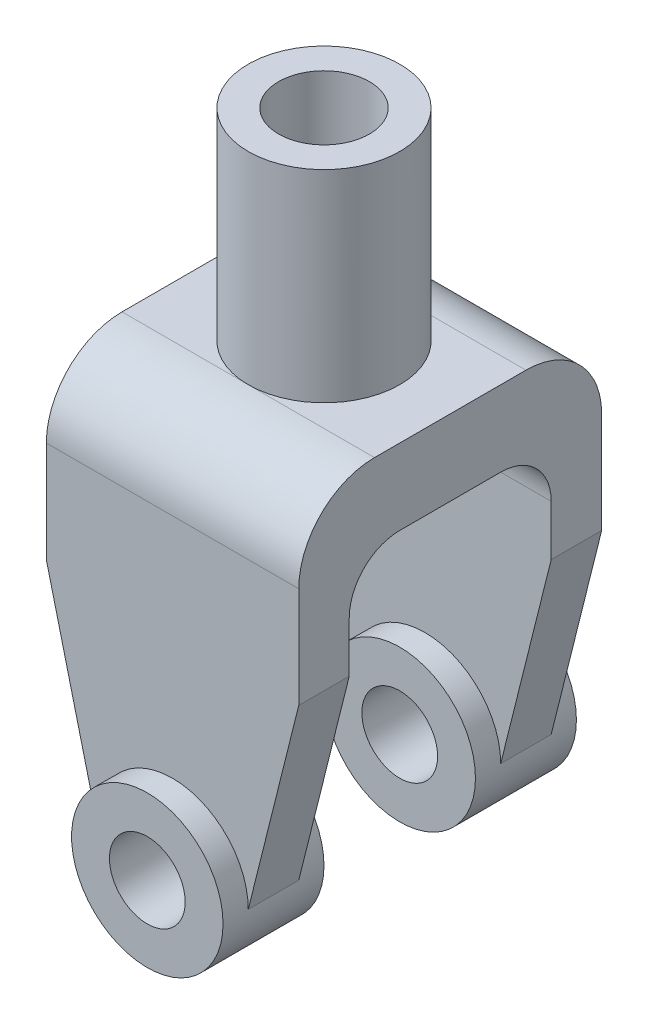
ISO-10303-21;
HEADER;
FILE_DESCRIPTION(('STEP AP214'),'2;1');
FILE_NAME('part.step','',(''),(''),'','','');
FILE_SCHEMA(('AUTOMOTIVE_DESIGN { 1 0 10303 214 1 1 1 1 }'));
ENDSEC;
DATA;
#1=APPLICATION_CONTEXT('core data for automotive mechanical design processes');
#2=APPLICATION_PROTOCOL_DEFINITION('international standard','automotive_design',2000,#1);
#3=PRODUCT_CONTEXT('',#1,'mechanical');
#4=PRODUCT('Part','Part','',(#3));
#5=PRODUCT_RELATED_PRODUCT_CATEGORY('part','',(#4));
#6=PRODUCT_DEFINITION_FORMATION('','',#4);
#7=PRODUCT_DEFINITION_CONTEXT('part definition',#1,'design');
#8=PRODUCT_DEFINITION('design','',#6,#7);
#9=PRODUCT_DEFINITION_SHAPE('','',#8);
#10=(LENGTH_UNIT() NAMED_UNIT(*) SI_UNIT(.MILLI.,.METRE.));
#11=(NAMED_UNIT(*) PLANE_ANGLE_UNIT() SI_UNIT($,.RADIAN.));
#12=(NAMED_UNIT(*) SI_UNIT($,.STERADIAN.) SOLID_ANGLE_UNIT());
#13=UNCERTAINTY_MEASURE_WITH_UNIT(LENGTH_MEASURE(1.E-05),#10,'distance_accuracy_value','');
#14=(GEOMETRIC_REPRESENTATION_CONTEXT(3) GLOBAL_UNCERTAINTY_ASSIGNED_CONTEXT((#13)) GLOBAL_UNIT_ASSIGNED_CONTEXT((#10,
#11,#12)) REPRESENTATION_CONTEXT('',''));
#15=CARTESIAN_POINT('',(0.,0.,0.));
#16=DIRECTION('',(0.,0.,1.));
#17=DIRECTION('',(1.,0.,0.));
#18=AXIS2_PLACEMENT_3D('',#15,#16,#17);
#19=CARTESIAN_POINT('',(50.,150.,0.));
#20=DIRECTION('',(0.,-1.,0.));
#21=DIRECTION('',(0.,0.,-1.));
#22=AXIS2_PLACEMENT_3D('',#19,#20,#21);
#23=PLANE('',#22);
#24=DIRECTION('',(0.,0.,1.));
#25=VECTOR('',#24,1.);
#26=CARTESIAN_POINT('',(50.,150.,0.));
#27=LINE('',#26,#25);
#28=CARTESIAN_POINT('',(50.,150.,-90.));
#29=VERTEX_POINT('',#28);
#30=CARTESIAN_POINT('',(50.,150.,-30.));
#31=VERTEX_POINT('',#30);
#32=EDGE_CURVE('E220',#29,#31,#27,.T.);
#33=ORIENTED_EDGE('',*,*,#32,.F.);
#34=DIRECTION('',(-1.,0.,0.));
#35=VECTOR('',#34,1.);
#36=CARTESIAN_POINT('',(50.,150.,-90.));
#37=LINE('',#36,#35);
#38=CARTESIAN_POINT('',(0.,150.,-90.));
#39=VERTEX_POINT('',#38);
#40=EDGE_CURVE('E246',#29,#39,#37,.T.);
#41=ORIENTED_EDGE('',*,*,#40,.T.);
#42=CARTESIAN_POINT('',(0.,150.,-60.));
#43=DIRECTION('',(0.,-1.,0.));
#44=DIRECTION('',(0.,0.,-1.));
#45=AXIS2_PLACEMENT_3D('',#42,#43,#44);
#46=CIRCLE('',#45,30.);
#47=CARTESIAN_POINT('',(0.,150.,-30.));
#48=VERTEX_POINT('',#47);
#49=EDGE_CURVE('E231',#48,#39,#46,.F.);
#50=ORIENTED_EDGE('',*,*,#49,.F.);
#51=DIRECTION('',(-1.,0.,0.));
#52=VECTOR('',#51,1.);
#53=CARTESIAN_POINT('',(50.,150.,-30.));
#54=LINE('',#53,#52);
#55=EDGE_CURVE('E240',#48,#31,#54,.F.);
#56=ORIENTED_EDGE('',*,*,#55,.T.);
#57=EDGE_LOOP('',(#33,#41,#50,#56));
#58=FACE_BOUND('',#57,.T.);
#59=ADVANCED_FACE('F35',(#58),#23,.F.);
#60=EDGE_CURVE('E237',#39,#48,#46,.F.);
#61=ORIENTED_EDGE('',*,*,#60,.F.);
#62=DIRECTION('',(-1.,0.,0.));
#63=VECTOR('',#62,1.);
#64=CARTESIAN_POINT('',(50.,150.,-90.));
#65=LINE('',#64,#63);
#66=CARTESIAN_POINT('',(-50.,150.,-90.));
#67=VERTEX_POINT('',#66);
#68=EDGE_CURVE('E244',#39,#67,#65,.T.);
#69=ORIENTED_EDGE('',*,*,#68,.T.);
#70=DIRECTION('',(0.,0.,1.));
#71=VECTOR('',#70,1.);
#72=CARTESIAN_POINT('',(-50.,150.,0.));
#73=LINE('',#72,#71);
#74=CARTESIAN_POINT('',(-50.,150.,-30.));
#75=VERTEX_POINT('',#74);
#76=EDGE_CURVE('E205',#67,#75,#73,.T.);
#77=ORIENTED_EDGE('',*,*,#76,.T.);
#78=DIRECTION('',(-1.,0.,0.));
#79=VECTOR('',#78,1.);
#80=CARTESIAN_POINT('',(50.,150.,-30.));
#81=LINE('',#80,#79);
#82=EDGE_CURVE('E242',#75,#48,#81,.F.);
#83=ORIENTED_EDGE('',*,*,#82,.T.);
#84=EDGE_LOOP('',(#61,#69,#77,#83));
#85=FACE_BOUND('',#84,.T.);
#86=ADVANCED_FACE('F354',(#85),#23,.F.);
#87=CARTESIAN_POINT('',(50.,120.,-20.));
#88=DIRECTION('',(0.,0.,1.));
#89=DIRECTION('',(0.,-1.,0.));
#90=AXIS2_PLACEMENT_3D('',#87,#88,#89);
#91=PLANE('',#90);
#92=DIRECTION('',(0.,1.,0.));
#93=VECTOR('',#92,1.);
#94=CARTESIAN_POINT('',(-50.,120.,-20.));
#95=LINE('',#94,#93);
#96=CARTESIAN_POINT('',(-50.,80.,-20.));
#97=VERTEX_POINT('',#96);
#98=CARTESIAN_POINT('',(-50.,100.,-20.));
#99=VERTEX_POINT('',#98);
#100=EDGE_CURVE('E195',#97,#99,#95,.T.);
#101=ORIENTED_EDGE('',*,*,#100,.T.);
#102=DIRECTION('',(-1.,0.,0.));
#103=VECTOR('',#102,1.);
#104=CARTESIAN_POINT('',(50.,100.,-20.));
#105=LINE('',#104,#103);
#106=CARTESIAN_POINT('',(50.,100.,-20.));
#107=VERTEX_POINT('',#106);
#108=EDGE_CURVE('E50',#99,#107,#105,.F.);
#109=ORIENTED_EDGE('',*,*,#108,.T.);
#110=DIRECTION('',(0.,1.,0.));
#111=VECTOR('',#110,1.);
#112=CARTESIAN_POINT('',(50.,120.,-20.));
#113=LINE('',#112,#111);
#114=CARTESIAN_POINT('',(50.,80.0000000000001,-20.));
#115=VERTEX_POINT('',#114);
#116=EDGE_CURVE('E210',#115,#107,#113,.T.);
#117=ORIENTED_EDGE('',*,*,#116,.F.);
#118=DIRECTION('',(0.242535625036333,0.970142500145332,0.));
#119=VECTOR('',#118,1.);
#120=CARTESIAN_POINT('',(59.4117647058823,117.647058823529,-20.));
#121=LINE('',#120,#119);
#122=CARTESIAN_POINT('',(30.,0.,-20.));
#123=VERTEX_POINT('',#122);
#124=EDGE_CURVE('E165',#123,#115,#121,.T.);
#125=ORIENTED_EDGE('',*,*,#124,.F.);
#126=CARTESIAN_POINT('',(0.,0.,-20.));
#127=DIRECTION('',(0.,0.,1.));
#128=DIRECTION('',(0.,-1.,0.));
#129=AXIS2_PLACEMENT_3D('',#126,#127,#128);
#130=CIRCLE('',#129,30.);
#131=CARTESIAN_POINT('',(-30.,0.,-20.));
#132=VERTEX_POINT('',#131);
#133=EDGE_CURVE('E302',#123,#132,#130,.T.);
#134=ORIENTED_EDGE('',*,*,#133,.T.);
#135=DIRECTION('',(0.242535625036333,-0.970142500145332,0.));
#136=VECTOR('',#135,1.);
#137=CARTESIAN_POINT('',(-53.5294117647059,94.1176470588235,-20.));
#138=LINE('',#137,#136);
#139=EDGE_CURVE('E166',#97,#132,#138,.T.);
#140=ORIENTED_EDGE('',*,*,#139,.F.);
#141=EDGE_LOOP('',(#101,#109,#117,#125,#134,#140));
#142=FACE_BOUND('',#141,.T.);
#143=ADVANCED_FACE('F37',(#142),#91,.F.);
#144=CARTESIAN_POINT('',(50.,120.,-100.));
#145=DIRECTION('',(0.,1.,0.));
#146=DIRECTION('',(0.,0.,1.));
#147=AXIS2_PLACEMENT_3D('',#144,#145,#146);
#148=PLANE('',#147);
#149=CARTESIAN_POINT('',(0.,120.,-60.));
#150=DIRECTION('',(0.,1.,0.));
#151=DIRECTION('',(0.,0.,1.));
#152=AXIS2_PLACEMENT_3D('',#149,#150,#151);
#153=CIRCLE('',#152,18.);
#154=CARTESIAN_POINT('',(0.,120.,-42.));
#155=VERTEX_POINT('',#154);
#156=EDGE_CURVE('E376',#155,#155,#153,.F.);
#157=ORIENTED_EDGE('',*,*,#156,.F.);
#158=EDGE_LOOP('',(#157));
#159=FACE_BOUND('',#158,.T.);
#160=DIRECTION('',(0.,0.,-1.));
#161=VECTOR('',#160,1.);
#162=CARTESIAN_POINT('',(-50.,120.,-100.));
#163=LINE('',#162,#161);
#164=CARTESIAN_POINT('',(-50.,120.,-40.));
#165=VERTEX_POINT('',#164);
#166=CARTESIAN_POINT('',(-50.,120.,-80.));
#167=VERTEX_POINT('',#166);
#168=EDGE_CURVE('E197',#165,#167,#163,.T.);
#169=ORIENTED_EDGE('',*,*,#168,.T.);
#170=DIRECTION('',(-1.,0.,0.));
#171=VECTOR('',#170,1.);
#172=CARTESIAN_POINT('',(50.,120.,-80.));
#173=LINE('',#172,#171);
#174=CARTESIAN_POINT('',(50.,120.,-80.));
#175=VERTEX_POINT('',#174);
#176=EDGE_CURVE('E268',#167,#175,#173,.F.);
#177=ORIENTED_EDGE('',*,*,#176,.T.);
#178=DIRECTION('',(0.,0.,-1.));
#179=VECTOR('',#178,1.);
#180=CARTESIAN_POINT('',(50.,120.,-100.));
#181=LINE('',#180,#179);
#182=CARTESIAN_POINT('',(50.,120.,-40.));
#183=VERTEX_POINT('',#182);
#184=EDGE_CURVE('E212',#183,#175,#181,.T.);
#185=ORIENTED_EDGE('',*,*,#184,.F.);
#186=DIRECTION('',(-1.,0.,0.));
#187=VECTOR('',#186,1.);
#188=CARTESIAN_POINT('',(-50.,120.,-40.));
#189=LINE('',#188,#187);
#190=EDGE_CURVE('E265',#183,#165,#189,.T.);
#191=ORIENTED_EDGE('',*,*,#190,.T.);
#192=EDGE_LOOP('',(#169,#177,#185,#191));
#193=FACE_BOUND('',#192,.T.);
#194=ADVANCED_FACE('F287',(#159,#193),#148,.F.);
#195=CARTESIAN_POINT('',(50.,0.,-100.));
#196=DIRECTION('',(0.,0.,-1.));
#197=DIRECTION('',(-1.,0.,0.));
#198=AXIS2_PLACEMENT_3D('',#195,#196,#197);
#199=PLANE('',#198);
#200=DIRECTION('',(0.,-1.,0.));
#201=VECTOR('',#200,1.);
#202=CARTESIAN_POINT('',(50.,0.,-100.));
#203=LINE('',#202,#201);
#204=CARTESIAN_POINT('',(50.,100.,-100.));
#205=VERTEX_POINT('',#204);
#206=CARTESIAN_POINT('',(50.,80.,-100.));
#207=VERTEX_POINT('',#206);
#208=EDGE_CURVE('E215',#205,#207,#203,.T.);
#209=ORIENTED_EDGE('',*,*,#208,.F.);
#210=DIRECTION('',(-1.,0.,0.));
#211=VECTOR('',#210,1.);
#212=CARTESIAN_POINT('',(-50.,100.,-100.));
#213=LINE('',#212,#211);
#214=CARTESIAN_POINT('',(-50.,100.,-100.));
#215=VERTEX_POINT('',#214);
#216=EDGE_CURVE('E262',#205,#215,#213,.T.);
#217=ORIENTED_EDGE('',*,*,#216,.T.);
#218=DIRECTION('',(0.,-1.,0.));
#219=VECTOR('',#218,1.);
#220=CARTESIAN_POINT('',(-50.,0.,-100.));
#221=LINE('',#220,#219);
#222=CARTESIAN_POINT('',(-50.,79.9999999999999,-100.));
#223=VERTEX_POINT('',#222);
#224=EDGE_CURVE('E200',#215,#223,#221,.T.);
#225=ORIENTED_EDGE('',*,*,#224,.T.);
#226=DIRECTION('',(-0.242535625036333,0.970142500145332,0.));
#227=VECTOR('',#226,1.);
#228=CARTESIAN_POINT('',(-25.2941176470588,-18.8235294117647,-100.));
#229=LINE('',#228,#227);
#230=CARTESIAN_POINT('',(-30.,0.,-100.));
#231=VERTEX_POINT('',#230);
#232=EDGE_CURVE('E173',#231,#223,#229,.T.);
#233=ORIENTED_EDGE('',*,*,#232,.F.);
#234=CARTESIAN_POINT('',(0.,0.,-100.));
#235=DIRECTION('',(0.,0.,-1.));
#236=DIRECTION('',(-1.,0.,0.));
#237=AXIS2_PLACEMENT_3D('',#234,#235,#236);
#238=CIRCLE('',#237,30.);
#239=CARTESIAN_POINT('',(30.,0.,-100.));
#240=VERTEX_POINT('',#239);
#241=EDGE_CURVE('E170',#231,#240,#238,.T.);
#242=ORIENTED_EDGE('',*,*,#241,.T.);
#243=DIRECTION('',(-0.242535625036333,-0.970142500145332,0.));
#244=VECTOR('',#243,1.);
#245=CARTESIAN_POINT('',(31.1764705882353,4.70588235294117,-100.));
#246=LINE('',#245,#244);
#247=EDGE_CURVE('E155',#207,#240,#246,.T.);
#248=ORIENTED_EDGE('',*,*,#247,.F.);
#249=EDGE_LOOP('',(#209,#217,#225,#233,#242,#248));
#250=FACE_BOUND('',#249,.T.);
#251=ADVANCED_FACE('F171',(#250),#199,.F.);
#252=CARTESIAN_POINT('',(50.,150.,-120.));
#253=DIRECTION('',(0.,0.,1.));
#254=DIRECTION('',(0.,-1.,0.));
#255=AXIS2_PLACEMENT_3D('',#252,#253,#254);
#256=PLANE('',#255);
#257=DIRECTION('',(0.,1.,0.));
#258=VECTOR('',#257,1.);
#259=CARTESIAN_POINT('',(-50.,150.,-120.));
#260=LINE('',#259,#258);
#261=CARTESIAN_POINT('',(-50.,80.,-120.));
#262=VERTEX_POINT('',#261);
#263=CARTESIAN_POINT('',(-50.,120.,-120.));
#264=VERTEX_POINT('',#263);
#265=EDGE_CURVE('E202',#262,#264,#260,.T.);
#266=ORIENTED_EDGE('',*,*,#265,.T.);
#267=DIRECTION('',(-1.,0.,0.));
#268=VECTOR('',#267,1.);
#269=CARTESIAN_POINT('',(50.,120.,-120.));
#270=LINE('',#269,#268);
#271=CARTESIAN_POINT('',(50.,120.,-120.));
#272=VERTEX_POINT('',#271);
#273=EDGE_CURVE('E253',#264,#272,#270,.F.);
#274=ORIENTED_EDGE('',*,*,#273,.T.);
#275=DIRECTION('',(0.,1.,0.));
#276=VECTOR('',#275,1.);
#277=CARTESIAN_POINT('',(50.,150.,-120.));
#278=LINE('',#277,#276);
#279=CARTESIAN_POINT('',(50.,80.,-120.));
#280=VERTEX_POINT('',#279);
#281=EDGE_CURVE('E217',#280,#272,#278,.T.);
#282=ORIENTED_EDGE('',*,*,#281,.F.);
#283=DIRECTION('',(0.242535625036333,0.970142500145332,0.));
#284=VECTOR('',#283,1.);
#285=CARTESIAN_POINT('',(30.,0.,-120.));
#286=LINE('',#285,#284);
#287=CARTESIAN_POINT('',(30.,0.,-120.));
#288=VERTEX_POINT('',#287);
#289=EDGE_CURVE('E318',#288,#280,#286,.T.);
#290=ORIENTED_EDGE('',*,*,#289,.F.);
#291=CARTESIAN_POINT('',(0.,0.,-120.));
#292=DIRECTION('',(0.,0.,1.));
#293=DIRECTION('',(0.,-1.,0.));
#294=AXIS2_PLACEMENT_3D('',#291,#292,#293);
#295=CIRCLE('',#294,30.);
#296=CARTESIAN_POINT('',(-30.,0.,-120.));
#297=VERTEX_POINT('',#296);
#298=EDGE_CURVE('E177',#288,#297,#295,.T.);
#299=ORIENTED_EDGE('',*,*,#298,.T.);
#300=DIRECTION('',(0.242535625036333,-0.970142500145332,0.));
#301=VECTOR('',#300,1.);
#302=CARTESIAN_POINT('',(-50.,80.,-120.));
#303=LINE('',#302,#301);
#304=EDGE_CURVE('E315',#262,#297,#303,.T.);
#305=ORIENTED_EDGE('',*,*,#304,.F.);
#306=EDGE_LOOP('',(#266,#274,#282,#290,#299,#305));
#307=FACE_BOUND('',#306,.T.);
#308=ADVANCED_FACE('F324',(#307),#256,.F.);
#309=CARTESIAN_POINT('',(50.,0.,0.));
#310=DIRECTION('',(0.,0.,-1.));
#311=DIRECTION('',(-1.,0.,0.));
#312=AXIS2_PLACEMENT_3D('',#309,#310,#311);
#313=PLANE('',#312);
#314=DIRECTION('',(0.,-1.,0.));
#315=VECTOR('',#314,1.);
#316=CARTESIAN_POINT('',(50.,0.,0.));
#317=LINE('',#316,#315);
#318=CARTESIAN_POINT('',(50.,120.,0.));
#319=VERTEX_POINT('',#318);
#320=CARTESIAN_POINT('',(50.,80.,0.));
#321=VERTEX_POINT('',#320);
#322=EDGE_CURVE('E223',#319,#321,#317,.T.);
#323=ORIENTED_EDGE('',*,*,#322,.F.);
#324=DIRECTION('',(-1.,0.,0.));
#325=VECTOR('',#324,1.);
#326=CARTESIAN_POINT('',(50.,120.,0.));
#327=LINE('',#326,#325);
#328=CARTESIAN_POINT('',(-50.,120.,0.));
#329=VERTEX_POINT('',#328);
#330=EDGE_CURVE('E259',#319,#329,#327,.T.);
#331=ORIENTED_EDGE('',*,*,#330,.T.);
#332=DIRECTION('',(0.,-1.,0.));
#333=VECTOR('',#332,1.);
#334=CARTESIAN_POINT('',(-50.,0.,0.));
#335=LINE('',#334,#333);
#336=CARTESIAN_POINT('',(-50.,80.,0.));
#337=VERTEX_POINT('',#336);
#338=EDGE_CURVE('E208',#329,#337,#335,.T.);
#339=ORIENTED_EDGE('',*,*,#338,.T.);
#340=DIRECTION('',(0.242535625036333,-0.970142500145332,0.));
#341=VECTOR('',#340,1.);
#342=CARTESIAN_POINT('',(-50.,80.,0.));
#343=LINE('',#342,#341);
#344=CARTESIAN_POINT('',(-30.,0.,0.));
#345=VERTEX_POINT('',#344);
#346=EDGE_CURVE('E305',#337,#345,#343,.T.);
#347=ORIENTED_EDGE('',*,*,#346,.T.);
#348=CARTESIAN_POINT('',(0.,0.,0.));
#349=DIRECTION('',(0.,0.,-1.));
#350=DIRECTION('',(-1.,0.,0.));
#351=AXIS2_PLACEMENT_3D('',#348,#349,#350);
#352=CIRCLE('',#351,30.);
#353=CARTESIAN_POINT('',(30.,0.,0.));
#354=VERTEX_POINT('',#353);
#355=EDGE_CURVE('E306',#345,#354,#352,.T.);
#356=ORIENTED_EDGE('',*,*,#355,.T.);
#357=DIRECTION('',(0.242535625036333,0.970142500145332,0.));
#358=VECTOR('',#357,1.);
#359=CARTESIAN_POINT('',(30.,0.,0.));
#360=LINE('',#359,#358);
#361=EDGE_CURVE('E297',#354,#321,#360,.T.);
#362=ORIENTED_EDGE('',*,*,#361,.T.);
#363=EDGE_LOOP('',(#323,#331,#339,#347,#356,#362));
#364=FACE_BOUND('',#363,.T.);
#365=ADVANCED_FACE('F364',(#364),#313,.F.);
#366=CARTESIAN_POINT('',(50.,0.,0.));
#367=DIRECTION('',(-1.,0.,0.));
#368=DIRECTION('',(0.,0.,1.));
#369=AXIS2_PLACEMENT_3D('',#366,#367,#368);
#370=PLANE('',#369);
#371=ORIENTED_EDGE('',*,*,#281,.T.);
#372=CARTESIAN_POINT('',(50.,120.,-90.));
#373=DIRECTION('',(-1.,0.,0.));
#374=DIRECTION('',(0.,0.,1.));
#375=AXIS2_PLACEMENT_3D('',#372,#373,#374);
#376=CIRCLE('',#375,30.);
#377=EDGE_CURVE('E257',#272,#29,#376,.F.);
#378=ORIENTED_EDGE('',*,*,#377,.T.);
#379=ORIENTED_EDGE('',*,*,#32,.T.);
#380=CARTESIAN_POINT('',(50.,120.,-30.));
#381=DIRECTION('',(-1.,0.,0.));
#382=DIRECTION('',(0.,0.,1.));
#383=AXIS2_PLACEMENT_3D('',#380,#381,#382);
#384=CIRCLE('',#383,30.);
#385=EDGE_CURVE('E255',#31,#319,#384,.F.);
#386=ORIENTED_EDGE('',*,*,#385,.T.);
#387=ORIENTED_EDGE('',*,*,#322,.T.);
#388=DIRECTION('',(0.,0.,1.));
#389=VECTOR('',#388,1.);
#390=CARTESIAN_POINT('',(50.,80.0000000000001,0.));
#391=LINE('',#390,#389);
#392=EDGE_CURVE('E228',#115,#321,#391,.T.);
#393=ORIENTED_EDGE('',*,*,#392,.F.);
#394=ORIENTED_EDGE('',*,*,#116,.T.);
#395=CARTESIAN_POINT('',(50.,100.,-40.));
#396=DIRECTION('',(-1.,0.,0.));
#397=DIRECTION('',(0.,0.,1.));
#398=AXIS2_PLACEMENT_3D('',#395,#396,#397);
#399=CIRCLE('',#398,20.);
#400=EDGE_CURVE('E11',#107,#183,#399,.T.);
#401=ORIENTED_EDGE('',*,*,#400,.T.);
#402=ORIENTED_EDGE('',*,*,#184,.T.);
#403=CARTESIAN_POINT('',(50.,100.,-80.));
#404=DIRECTION('',(-1.,0.,0.));
#405=DIRECTION('',(0.,0.,1.));
#406=AXIS2_PLACEMENT_3D('',#403,#404,#405);
#407=CIRCLE('',#406,20.);
#408=EDGE_CURVE('E273',#175,#205,#407,.T.);
#409=ORIENTED_EDGE('',*,*,#408,.T.);
#410=ORIENTED_EDGE('',*,*,#208,.T.);
#411=DIRECTION('',(0.,0.,1.));
#412=VECTOR('',#411,1.);
#413=CARTESIAN_POINT('',(50.,80.,-120.));
#414=LINE('',#413,#412);
#415=EDGE_CURVE('E162',#280,#207,#414,.T.);
#416=ORIENTED_EDGE('',*,*,#415,.F.);
#417=EDGE_LOOP('',(#371,#378,#379,#386,#387,#393,#394,#401,#402,#409,#410,#416));
#418=FACE_BOUND('',#417,.T.);
#419=ADVANCED_FACE('F276',(#418),#370,.F.);
#420=CARTESIAN_POINT('',(-50.,0.,0.));
#421=DIRECTION('',(-1.,0.,0.));
#422=DIRECTION('',(0.,0.,1.));
#423=AXIS2_PLACEMENT_3D('',#420,#421,#422);
#424=PLANE('',#423);
#425=ORIENTED_EDGE('',*,*,#76,.F.);
#426=CARTESIAN_POINT('',(-50.,120.,-90.));
#427=DIRECTION('',(-1.,0.,0.));
#428=DIRECTION('',(0.,0.,1.));
#429=AXIS2_PLACEMENT_3D('',#426,#427,#428);
#430=CIRCLE('',#429,30.);
#431=EDGE_CURVE('E251',#67,#264,#430,.T.);
#432=ORIENTED_EDGE('',*,*,#431,.T.);
#433=ORIENTED_EDGE('',*,*,#265,.F.);
#434=DIRECTION('',(0.,0.,1.));
#435=VECTOR('',#434,1.);
#436=CARTESIAN_POINT('',(-50.,80.,-120.));
#437=LINE('',#436,#435);
#438=EDGE_CURVE('E182',#262,#223,#437,.T.);
#439=ORIENTED_EDGE('',*,*,#438,.T.);
#440=ORIENTED_EDGE('',*,*,#224,.F.);
#441=CARTESIAN_POINT('',(-50.,100.,-80.));
#442=DIRECTION('',(-1.,0.,0.));
#443=DIRECTION('',(0.,0.,1.));
#444=AXIS2_PLACEMENT_3D('',#441,#442,#443);
#445=CIRCLE('',#444,20.);
#446=EDGE_CURVE('E271',#215,#167,#445,.F.);
#447=ORIENTED_EDGE('',*,*,#446,.T.);
#448=ORIENTED_EDGE('',*,*,#168,.F.);
#449=CARTESIAN_POINT('',(-50.,100.,-40.));
#450=DIRECTION('',(-1.,0.,0.));
#451=DIRECTION('',(0.,0.,1.));
#452=AXIS2_PLACEMENT_3D('',#449,#450,#451);
#453=CIRCLE('',#452,20.);
#454=EDGE_CURVE('E43',#165,#99,#453,.F.);
#455=ORIENTED_EDGE('',*,*,#454,.T.);
#456=ORIENTED_EDGE('',*,*,#100,.F.);
#457=DIRECTION('',(0.,0.,1.));
#458=VECTOR('',#457,1.);
#459=CARTESIAN_POINT('',(-50.,79.9999999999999,0.));
#460=LINE('',#459,#458);
#461=EDGE_CURVE('E225',#97,#337,#460,.T.);
#462=ORIENTED_EDGE('',*,*,#461,.T.);
#463=ORIENTED_EDGE('',*,*,#338,.F.);
#464=CARTESIAN_POINT('',(-50.,120.,-30.));
#465=DIRECTION('',(-1.,0.,0.));
#466=DIRECTION('',(0.,0.,1.));
#467=AXIS2_PLACEMENT_3D('',#464,#465,#466);
#468=CIRCLE('',#467,30.);
#469=EDGE_CURVE('E249',#329,#75,#468,.T.);
#470=ORIENTED_EDGE('',*,*,#469,.T.);
#471=EDGE_LOOP('',(#425,#432,#433,#439,#440,#447,#448,#455,#456,#462,#463,#470));
#472=FACE_BOUND('',#471,.T.);
#473=ADVANCED_FACE('F284',(#472),#424,.T.);
#474=CARTESIAN_POINT('',(-50.,80.,-120.));
#475=DIRECTION('',(-0.970142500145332,-0.242535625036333,0.));
#476=DIRECTION('',(0.242535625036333,-0.970142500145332,0.));
#477=AXIS2_PLACEMENT_3D('',#474,#475,#476);
#478=PLANE('',#477);
#479=ORIENTED_EDGE('',*,*,#461,.F.);
#480=ORIENTED_EDGE('',*,*,#139,.T.);
#481=DIRECTION('',(0.,0.,1.));
#482=VECTOR('',#481,1.);
#483=CARTESIAN_POINT('',(-30.,0.,-120.));
#484=LINE('',#483,#482);
#485=EDGE_CURVE('E189',#132,#345,#484,.T.);
#486=ORIENTED_EDGE('',*,*,#485,.T.);
#487=ORIENTED_EDGE('',*,*,#346,.F.);
#488=EDGE_LOOP('',(#479,#480,#486,#487));
#489=FACE_BOUND('',#488,.T.);
#490=ADVANCED_FACE('F522',(#489),#478,.T.);
#491=EDGE_CURVE('E185',#297,#231,#484,.T.);
#492=ORIENTED_EDGE('',*,*,#491,.T.);
#493=ORIENTED_EDGE('',*,*,#232,.T.);
#494=ORIENTED_EDGE('',*,*,#438,.F.);
#495=ORIENTED_EDGE('',*,*,#304,.T.);
#496=EDGE_LOOP('',(#492,#493,#494,#495));
#497=FACE_BOUND('',#496,.T.);
#498=ADVANCED_FACE('F322',(#497),#478,.T.);
#499=CARTESIAN_POINT('',(30.,0.,-120.));
#500=DIRECTION('',(0.970142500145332,-0.242535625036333,0.));
#501=DIRECTION('',(0.242535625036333,0.970142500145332,0.));
#502=AXIS2_PLACEMENT_3D('',#499,#500,#501);
#503=PLANE('',#502);
#504=DIRECTION('',(0.,0.,1.));
#505=VECTOR('',#504,1.);
#506=CARTESIAN_POINT('',(30.,0.,-120.));
#507=LINE('',#506,#505);
#508=EDGE_CURVE('E180',#123,#354,#507,.T.);
#509=ORIENTED_EDGE('',*,*,#508,.F.);
#510=ORIENTED_EDGE('',*,*,#124,.T.);
#511=ORIENTED_EDGE('',*,*,#392,.T.);
#512=ORIENTED_EDGE('',*,*,#361,.F.);
#513=EDGE_LOOP('',(#509,#510,#511,#512));
#514=FACE_BOUND('',#513,.T.);
#515=ADVANCED_FACE('F294',(#514),#503,.T.);
#516=ORIENTED_EDGE('',*,*,#415,.T.);
#517=ORIENTED_EDGE('',*,*,#247,.T.);
#518=EDGE_CURVE('E160',#288,#240,#507,.T.);
#519=ORIENTED_EDGE('',*,*,#518,.F.);
#520=ORIENTED_EDGE('',*,*,#289,.T.);
#521=EDGE_LOOP('',(#516,#517,#519,#520));
#522=FACE_BOUND('',#521,.T.);
#523=ADVANCED_FACE('F157',(#522),#503,.T.);
#524=CARTESIAN_POINT('',(0.,0.,-30.));
#525=DIRECTION('',(0.,0.,1.));
#526=DIRECTION('',(1.,0.,0.));
#527=AXIS2_PLACEMENT_3D('',#524,#525,#526);
#528=CYLINDRICAL_SURFACE('',#527,30.);
#529=CARTESIAN_POINT('',(0.,0.,10.));
#530=DIRECTION('',(0.,0.,1.));
#531=DIRECTION('',(1.,0.,0.));
#532=AXIS2_PLACEMENT_3D('',#529,#530,#531);
#533=CIRCLE('',#532,30.);
#534=CARTESIAN_POINT('',(30.,0.,10.));
#535=VERTEX_POINT('',#534);
#536=EDGE_CURVE('E176',#535,#535,#533,.T.);
#537=ORIENTED_EDGE('',*,*,#536,.F.);
#538=EDGE_LOOP('',(#537));
#539=FACE_BOUND('',#538,.T.);
#540=CARTESIAN_POINT('',(0.,0.,-30.));
#541=DIRECTION('',(0.,0.,1.));
#542=DIRECTION('',(1.,0.,0.));
#543=AXIS2_PLACEMENT_3D('',#540,#541,#542);
#544=CIRCLE('',#543,30.);
#545=CARTESIAN_POINT('',(30.,0.,-30.));
#546=VERTEX_POINT('',#545);
#547=EDGE_CURVE('E310',#546,#546,#544,.T.);
#548=ORIENTED_EDGE('',*,*,#547,.T.);
#549=EDGE_LOOP('',(#548));
#550=FACE_BOUND('',#549,.T.);
#551=ORIENTED_EDGE('',*,*,#485,.F.);
#552=ORIENTED_EDGE('',*,*,#133,.F.);
#553=ORIENTED_EDGE('',*,*,#508,.T.);
#554=ORIENTED_EDGE('',*,*,#355,.F.);
#555=EDGE_LOOP('',(#551,#552,#553,#554));
#556=FACE_BOUND('',#555,.T.);
#557=ADVANCED_FACE('F303',(#539,#550,#556),#528,.T.);
#558=CARTESIAN_POINT('',(0.,0.,-30.));
#559=DIRECTION('',(0.,0.,1.));
#560=DIRECTION('',(1.,0.,0.));
#561=AXIS2_PLACEMENT_3D('',#558,#559,#560);
#562=PLANE('',#561);
#563=CARTESIAN_POINT('',(0.,0.,-30.));
#564=DIRECTION('',(0.,0.,1.));
#565=DIRECTION('',(1.,0.,0.));
#566=AXIS2_PLACEMENT_3D('',#563,#564,#565);
#567=CIRCLE('',#566,15.);
#568=CARTESIAN_POINT('',(15.,0.,-30.));
#569=VERTEX_POINT('',#568);
#570=EDGE_CURVE('E235',#569,#569,#567,.T.);
#571=ORIENTED_EDGE('',*,*,#570,.T.);
#572=EDGE_LOOP('',(#571));
#573=FACE_BOUND('',#572,.T.);
#574=ORIENTED_EDGE('',*,*,#547,.F.);
#575=EDGE_LOOP('',(#574));
#576=FACE_BOUND('',#575,.T.);
#577=ADVANCED_FACE('F339',(#573,#576),#562,.F.);
#578=CARTESIAN_POINT('',(0.,0.,10.));
#579=DIRECTION('',(0.,0.,1.));
#580=DIRECTION('',(1.,0.,0.));
#581=AXIS2_PLACEMENT_3D('',#578,#579,#580);
#582=PLANE('',#581);
#583=CARTESIAN_POINT('',(0.,0.,10.));
#584=DIRECTION('',(0.,0.,1.));
#585=DIRECTION('',(1.,0.,0.));
#586=AXIS2_PLACEMENT_3D('',#583,#584,#585);
#587=CIRCLE('',#586,15.);
#588=CARTESIAN_POINT('',(15.,0.,10.));
#589=VERTEX_POINT('',#588);
#590=EDGE_CURVE('E382',#589,#589,#587,.T.);
#591=ORIENTED_EDGE('',*,*,#590,.F.);
#592=EDGE_LOOP('',(#591));
#593=FACE_BOUND('',#592,.T.);
#594=ORIENTED_EDGE('',*,*,#536,.T.);
#595=EDGE_LOOP('',(#594));
#596=FACE_BOUND('',#595,.T.);
#597=ADVANCED_FACE('F341',(#593,#596),#582,.T.);
#598=CARTESIAN_POINT('',(0.,0.,-130.));
#599=DIRECTION('',(0.,0.,1.));
#600=DIRECTION('',(1.,0.,0.));
#601=AXIS2_PLACEMENT_3D('',#598,#599,#600);
#602=CYLINDRICAL_SURFACE('',#601,30.);
#603=CARTESIAN_POINT('',(0.,0.,-130.));
#604=DIRECTION('',(0.,0.,1.));
#605=DIRECTION('',(1.,0.,0.));
#606=AXIS2_PLACEMENT_3D('',#603,#604,#605);
#607=CIRCLE('',#606,30.);
#608=CARTESIAN_POINT('',(30.,0.,-130.));
#609=VERTEX_POINT('',#608);
#610=EDGE_CURVE('E327',#609,#609,#607,.T.);
#611=ORIENTED_EDGE('',*,*,#610,.T.);
#612=EDGE_LOOP('',(#611));
#613=FACE_BOUND('',#612,.T.);
#614=CARTESIAN_POINT('',(0.,0.,-90.));
#615=DIRECTION('',(0.,0.,1.));
#616=DIRECTION('',(1.,0.,0.));
#617=AXIS2_PLACEMENT_3D('',#614,#615,#616);
#618=CIRCLE('',#617,30.);
#619=CARTESIAN_POINT('',(30.,0.,-90.));
#620=VERTEX_POINT('',#619);
#621=EDGE_CURVE('E330',#620,#620,#618,.T.);
#622=ORIENTED_EDGE('',*,*,#621,.F.);
#623=EDGE_LOOP('',(#622));
#624=FACE_BOUND('',#623,.T.);
#625=ORIENTED_EDGE('',*,*,#241,.F.);
#626=ORIENTED_EDGE('',*,*,#491,.F.);
#627=ORIENTED_EDGE('',*,*,#298,.F.);
#628=ORIENTED_EDGE('',*,*,#518,.T.);
#629=EDGE_LOOP('',(#625,#626,#627,#628));
#630=FACE_BOUND('',#629,.T.);
#631=ADVANCED_FACE('F179',(#613,#624,#630),#602,.T.);
#632=CARTESIAN_POINT('',(0.,0.,-130.));
#633=DIRECTION('',(0.,0.,1.));
#634=DIRECTION('',(1.,0.,0.));
#635=AXIS2_PLACEMENT_3D('',#632,#633,#634);
#636=PLANE('',#635);
#637=CARTESIAN_POINT('',(0.,0.,-130.));
#638=DIRECTION('',(0.,0.,1.));
#639=DIRECTION('',(1.,0.,0.));
#640=AXIS2_PLACEMENT_3D('',#637,#638,#639);
#641=CIRCLE('',#640,15.);
#642=CARTESIAN_POINT('',(15.,0.,-130.));
#643=VERTEX_POINT('',#642);
#644=EDGE_CURVE('E236',#643,#643,#641,.T.);
#645=ORIENTED_EDGE('',*,*,#644,.T.);
#646=EDGE_LOOP('',(#645));
#647=FACE_BOUND('',#646,.T.);
#648=ORIENTED_EDGE('',*,*,#610,.F.);
#649=EDGE_LOOP('',(#648));
#650=FACE_BOUND('',#649,.T.);
#651=ADVANCED_FACE('F397',(#647,#650),#636,.F.);
#652=CARTESIAN_POINT('',(0.,0.,-90.));
#653=DIRECTION('',(0.,0.,1.));
#654=DIRECTION('',(1.,0.,0.));
#655=AXIS2_PLACEMENT_3D('',#652,#653,#654);
#656=PLANE('',#655);
#657=CARTESIAN_POINT('',(0.,0.,-90.));
#658=DIRECTION('',(0.,0.,1.));
#659=DIRECTION('',(1.,0.,0.));
#660=AXIS2_PLACEMENT_3D('',#657,#658,#659);
#661=CIRCLE('',#660,15.);
#662=CARTESIAN_POINT('',(15.,0.,-90.));
#663=VERTEX_POINT('',#662);
#664=EDGE_CURVE('E232',#663,#663,#661,.T.);
#665=ORIENTED_EDGE('',*,*,#664,.F.);
#666=EDGE_LOOP('',(#665));
#667=FACE_BOUND('',#666,.T.);
#668=ORIENTED_EDGE('',*,*,#621,.T.);
#669=EDGE_LOOP('',(#668));
#670=FACE_BOUND('',#669,.T.);
#671=ADVANCED_FACE('F394',(#667,#670),#656,.T.);
#672=CARTESIAN_POINT('',(0.,0.,-130.));
#673=DIRECTION('',(0.,0.,1.));
#674=DIRECTION('',(1.,0.,0.));
#675=AXIS2_PLACEMENT_3D('',#672,#673,#674);
#676=CYLINDRICAL_SURFACE('',#675,15.);
#677=ORIENTED_EDGE('',*,*,#664,.T.);
#678=EDGE_LOOP('',(#677));
#679=FACE_BOUND('',#678,.T.);
#680=ORIENTED_EDGE('',*,*,#644,.F.);
#681=EDGE_LOOP('',(#680));
#682=FACE_BOUND('',#681,.T.);
#683=ADVANCED_FACE('F405',(#679,#682),#676,.F.);
#684=ORIENTED_EDGE('',*,*,#590,.T.);
#685=EDGE_LOOP('',(#684));
#686=FACE_BOUND('',#685,.T.);
#687=ORIENTED_EDGE('',*,*,#570,.F.);
#688=EDGE_LOOP('',(#687));
#689=FACE_BOUND('',#688,.T.);
#690=ADVANCED_FACE('F412',(#686,#689),#676,.F.);
#691=CARTESIAN_POINT('',(0.,230.,-60.));
#692=DIRECTION('',(0.,-1.,0.));
#693=DIRECTION('',(0.,0.,-1.));
#694=AXIS2_PLACEMENT_3D('',#691,#692,#693);
#695=CYLINDRICAL_SURFACE('',#694,30.);
#696=CARTESIAN_POINT('',(0.,230.,-60.));
#697=DIRECTION('',(0.,1.,0.));
#698=DIRECTION('',(0.,0.,1.));
#699=AXIS2_PLACEMENT_3D('',#696,#697,#698);
#700=CIRCLE('',#699,30.);
#701=CARTESIAN_POINT('',(0.,230.,-30.));
#702=VERTEX_POINT('',#701);
#703=EDGE_CURVE('E378',#702,#702,#700,.T.);
#704=ORIENTED_EDGE('',*,*,#703,.F.);
#705=EDGE_LOOP('',(#704));
#706=FACE_BOUND('',#705,.T.);
#707=ORIENTED_EDGE('',*,*,#60,.T.);
#708=ORIENTED_EDGE('',*,*,#49,.T.);
#709=EDGE_LOOP('',(#707,#708));
#710=FACE_BOUND('',#709,.T.);
#711=ADVANCED_FACE('F417',(#706,#710),#695,.T.);
#712=CARTESIAN_POINT('',(0.,230.,-60.));
#713=DIRECTION('',(0.,1.,0.));
#714=DIRECTION('',(0.,0.,1.));
#715=AXIS2_PLACEMENT_3D('',#712,#713,#714);
#716=PLANE('',#715);
#717=CARTESIAN_POINT('',(0.,230.,-60.));
#718=DIRECTION('',(0.,1.,0.));
#719=DIRECTION('',(0.,0.,1.));
#720=AXIS2_PLACEMENT_3D('',#717,#718,#719);
#721=CIRCLE('',#720,18.);
#722=CARTESIAN_POINT('',(0.,230.,-42.));
#723=VERTEX_POINT('',#722);
#724=EDGE_CURVE('E379',#723,#723,#721,.T.);
#725=ORIENTED_EDGE('',*,*,#724,.F.);
#726=EDGE_LOOP('',(#725));
#727=FACE_BOUND('',#726,.T.);
#728=ORIENTED_EDGE('',*,*,#703,.T.);
#729=EDGE_LOOP('',(#728));
#730=FACE_BOUND('',#729,.T.);
#731=ADVANCED_FACE('F420',(#727,#730),#716,.T.);
#732=CARTESIAN_POINT('',(0.,-30.001,-60.));
#733=DIRECTION('',(0.,1.,0.));
#734=DIRECTION('',(0.,0.,1.));
#735=AXIS2_PLACEMENT_3D('',#732,#733,#734);
#736=CYLINDRICAL_SURFACE('',#735,18.);
#737=ORIENTED_EDGE('',*,*,#724,.T.);
#738=EDGE_LOOP('',(#737));
#739=FACE_BOUND('',#738,.T.);
#740=ORIENTED_EDGE('',*,*,#156,.T.);
#741=EDGE_LOOP('',(#740));
#742=FACE_BOUND('',#741,.T.);
#743=ADVANCED_FACE('F424',(#739,#742),#736,.F.);
#744=CARTESIAN_POINT('',(50.,120.,-90.));
#745=DIRECTION('',(-1.,0.,0.));
#746=DIRECTION('',(0.,0.,1.));
#747=AXIS2_PLACEMENT_3D('',#744,#745,#746);
#748=CYLINDRICAL_SURFACE('',#747,30.);
#749=ORIENTED_EDGE('',*,*,#377,.F.);
#750=ORIENTED_EDGE('',*,*,#273,.F.);
#751=ORIENTED_EDGE('',*,*,#431,.F.);
#752=ORIENTED_EDGE('',*,*,#68,.F.);
#753=ORIENTED_EDGE('',*,*,#40,.F.);
#754=EDGE_LOOP('',(#749,#750,#751,#752,#753));
#755=FACE_BOUND('',#754,.T.);
#756=ADVANCED_FACE('F428',(#755),#748,.T.);
#757=CARTESIAN_POINT('',(50.,120.,-30.));
#758=DIRECTION('',(-1.,0.,0.));
#759=DIRECTION('',(0.,0.,1.));
#760=AXIS2_PLACEMENT_3D('',#757,#758,#759);
#761=CYLINDRICAL_SURFACE('',#760,30.);
#762=ORIENTED_EDGE('',*,*,#55,.F.);
#763=ORIENTED_EDGE('',*,*,#82,.F.);
#764=ORIENTED_EDGE('',*,*,#469,.F.);
#765=ORIENTED_EDGE('',*,*,#330,.F.);
#766=ORIENTED_EDGE('',*,*,#385,.F.);
#767=EDGE_LOOP('',(#762,#763,#764,#765,#766));
#768=FACE_BOUND('',#767,.T.);
#769=ADVANCED_FACE('F432',(#768),#761,.T.);
#770=CARTESIAN_POINT('',(50.,100.,-80.));
#771=DIRECTION('',(1.,0.,0.));
#772=DIRECTION('',(0.,0.,-1.));
#773=AXIS2_PLACEMENT_3D('',#770,#771,#772);
#774=CYLINDRICAL_SURFACE('',#773,20.);
#775=ORIENTED_EDGE('',*,*,#408,.F.);
#776=ORIENTED_EDGE('',*,*,#176,.F.);
#777=ORIENTED_EDGE('',*,*,#446,.F.);
#778=ORIENTED_EDGE('',*,*,#216,.F.);
#779=EDGE_LOOP('',(#775,#776,#777,#778));
#780=FACE_BOUND('',#779,.T.);
#781=ADVANCED_FACE('F282',(#780),#774,.F.);
#782=CARTESIAN_POINT('',(50.,100.,-40.));
#783=DIRECTION('',(1.,0.,0.));
#784=DIRECTION('',(0.,0.,-1.));
#785=AXIS2_PLACEMENT_3D('',#782,#783,#784);
#786=CYLINDRICAL_SURFACE('',#785,20.);
#787=ORIENTED_EDGE('',*,*,#400,.F.);
#788=ORIENTED_EDGE('',*,*,#108,.F.);
#789=ORIENTED_EDGE('',*,*,#454,.F.);
#790=ORIENTED_EDGE('',*,*,#190,.F.);
#791=EDGE_LOOP('',(#787,#788,#789,#790));
#792=FACE_BOUND('',#791,.T.);
#793=ADVANCED_FACE('F291',(#792),#786,.F.);
#794=CLOSED_SHELL('',(#59,#86,#143,#194,#251,#308,#365,#419,#473,#490,#498,#515,#523,#557,#577,
#597,#631,#651,#671,#683,#690,#711,#731,#743,#756,#769,#781,#793));
#795=MANIFOLD_SOLID_BREP('B2',#794);
#796=ADVANCED_BREP_SHAPE_REPRESENTATION('',(#18,#795),#14);
#797=SHAPE_DEFINITION_REPRESENTATION(#9,#796);
ENDSEC;
END-ISO-10303-21;
